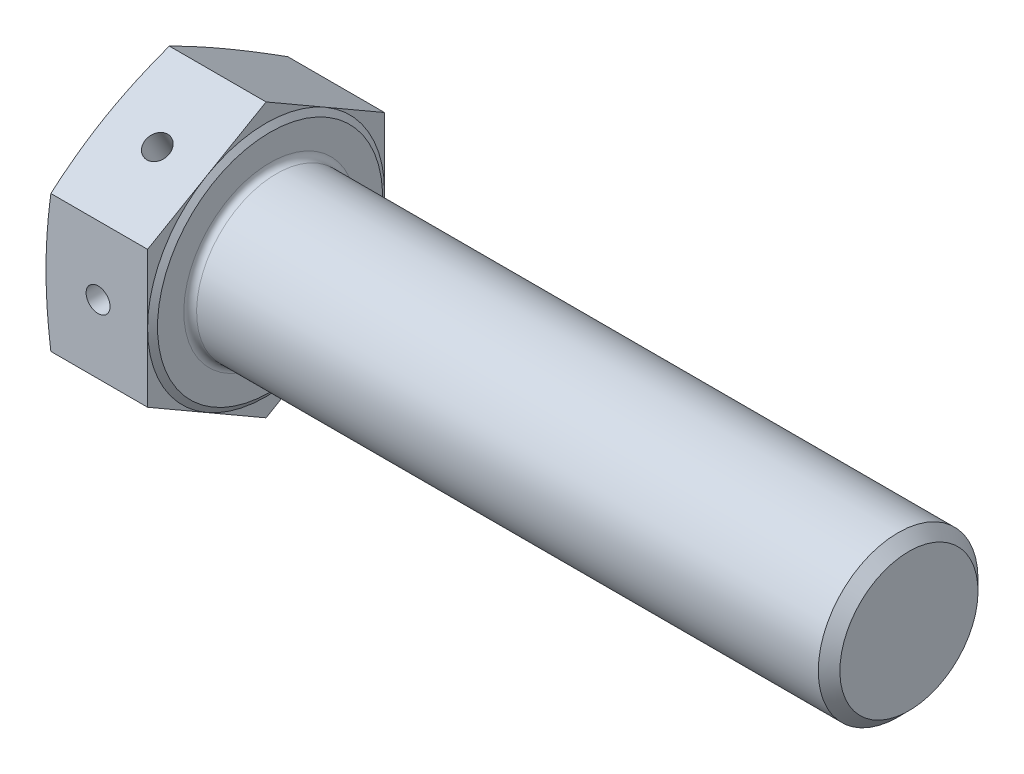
ISO-10303-21;
HEADER;
FILE_DESCRIPTION(('STEP AP214'),'2;1');
FILE_NAME('part.step','',(''),(''),'','','');
FILE_SCHEMA(('AUTOMOTIVE_DESIGN { 1 0 10303 214 1 1 1 1 }'));
ENDSEC;
DATA;
#1=APPLICATION_CONTEXT('core data for automotive mechanical design processes');
#2=APPLICATION_PROTOCOL_DEFINITION('international standard','automotive_design',2000,#1);
#3=PRODUCT_CONTEXT('',#1,'mechanical');
#4=PRODUCT('Part','Part','',(#3));
#5=PRODUCT_RELATED_PRODUCT_CATEGORY('part','',(#4));
#6=PRODUCT_DEFINITION_FORMATION('','',#4);
#7=PRODUCT_DEFINITION_CONTEXT('part definition',#1,'design');
#8=PRODUCT_DEFINITION('design','',#6,#7);
#9=PRODUCT_DEFINITION_SHAPE('','',#8);
#10=(LENGTH_UNIT() NAMED_UNIT(*) SI_UNIT(.MILLI.,.METRE.));
#11=(NAMED_UNIT(*) PLANE_ANGLE_UNIT() SI_UNIT($,.RADIAN.));
#12=(NAMED_UNIT(*) SI_UNIT($,.STERADIAN.) SOLID_ANGLE_UNIT());
#13=UNCERTAINTY_MEASURE_WITH_UNIT(LENGTH_MEASURE(1.E-05),#10,'distance_accuracy_value','');
#14=(GEOMETRIC_REPRESENTATION_CONTEXT(3) GLOBAL_UNCERTAINTY_ASSIGNED_CONTEXT((#13)) GLOBAL_UNIT_ASSIGNED_CONTEXT((#10,
#11,#12)) REPRESENTATION_CONTEXT('',''));
#15=CARTESIAN_POINT('',(0.,0.,0.));
#16=DIRECTION('',(0.,0.,1.));
#17=DIRECTION('',(1.,0.,0.));
#18=AXIS2_PLACEMENT_3D('',#15,#16,#17);
#19=CARTESIAN_POINT('',(6.52,0.,-14.835));
#20=DIRECTION('',(0.,0.,1.));
#21=DIRECTION('',(1.,0.,0.));
#22=AXIS2_PLACEMENT_3D('',#19,#20,#21);
#23=CYLINDRICAL_SURFACE('',#22,1.5);
#24=CARTESIAN_POINT('',(6.52,0.,14.835));
#25=DIRECTION('',(0.,0.,1.));
#26=DIRECTION('',(1.,0.,0.));
#27=AXIS2_PLACEMENT_3D('',#24,#25,#26);
#28=CIRCLE('',#27,1.5);
#29=CARTESIAN_POINT('',(8.02,0.,14.835));
#30=VERTEX_POINT('',#29);
#31=EDGE_CURVE('E584',#30,#30,#28,.T.);
#32=ORIENTED_EDGE('',*,*,#31,.T.);
#33=EDGE_LOOP('',(#32));
#34=FACE_BOUND('',#33,.T.);
#35=CARTESIAN_POINT('',(6.52,0.,0.));
#36=DIRECTION('',(0.,-0.866025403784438,0.500000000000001));
#37=DIRECTION('',(0.,0.500000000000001,0.866025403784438));
#38=AXIS2_PLACEMENT_3D('',#35,#36,#37);
#39=ELLIPSE('',#38,3.,1.5);
#40=CARTESIAN_POINT('',(5.02,0.,0.));
#41=VERTEX_POINT('',#40);
#42=CARTESIAN_POINT('',(8.02,0.,0.));
#43=VERTEX_POINT('',#42);
#44=EDGE_CURVE('E46',#41,#43,#39,.F.);
#45=ORIENTED_EDGE('',*,*,#44,.T.);
#46=CARTESIAN_POINT('',(6.52,0.,0.));
#47=DIRECTION('',(0.,0.500000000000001,0.866025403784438));
#48=DIRECTION('',(0.,-0.866025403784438,0.500000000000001));
#49=AXIS2_PLACEMENT_3D('',#46,#47,#48);
#50=ELLIPSE('',#49,1.73205080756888,1.5);
#51=EDGE_CURVE('E11',#43,#41,#50,.F.);
#52=ORIENTED_EDGE('',*,*,#51,.T.);
#53=EDGE_LOOP('',(#45,#52));
#54=FACE_BOUND('',#53,.T.);
#55=ADVANCED_FACE('F32',(#34,#54),#23,.F.);
#56=CARTESIAN_POINT('',(13.22,0.,0.));
#57=DIRECTION('',(-1.,0.,0.));
#58=DIRECTION('',(0.,-1.,0.));
#59=AXIS2_PLACEMENT_3D('',#56,#57,#58);
#60=PLANE('',#59);
#61=CARTESIAN_POINT('',(13.22,0.,0.));
#62=DIRECTION('',(-1.,0.,0.));
#63=DIRECTION('',(0.,-1.,0.));
#64=AXIS2_PLACEMENT_3D('',#61,#62,#63);
#65=CIRCLE('',#64,10.8);
#66=CARTESIAN_POINT('',(13.22,-10.8,0.));
#67=VERTEX_POINT('',#66);
#68=EDGE_CURVE('E137',#67,#67,#65,.T.);
#69=ORIENTED_EDGE('',*,*,#68,.T.);
#70=EDGE_LOOP('',(#69));
#71=FACE_BOUND('',#70,.T.);
#72=CARTESIAN_POINT('',(13.22,0.,0.));
#73=DIRECTION('',(-1.,0.,0.));
#74=DIRECTION('',(0.,-1.,0.));
#75=AXIS2_PLACEMENT_3D('',#72,#73,#74);
#76=CIRCLE('',#75,14.095);
#77=CARTESIAN_POINT('',(13.22,-14.095,0.));
#78=VERTEX_POINT('',#77);
#79=EDGE_CURVE('E286',#78,#78,#76,.T.);
#80=ORIENTED_EDGE('',*,*,#79,.F.);
#81=EDGE_LOOP('',(#80));
#82=FACE_BOUND('',#81,.T.);
#83=ADVANCED_FACE('F240',(#71,#82),#60,.F.);
#84=CARTESIAN_POINT('',(12.72,0.,29.67));
#85=DIRECTION('',(-1.,0.,0.));
#86=DIRECTION('',(0.,0.,1.));
#87=AXIS2_PLACEMENT_3D('',#84,#85,#86);
#88=PLANE('',#87);
#89=DIRECTION('',(0.,-0.5,-0.866025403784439));
#90=VECTOR('',#89,1.);
#91=CARTESIAN_POINT('',(12.72,-8.5649912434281,14.835));
#92=LINE('',#91,#90);
#93=CARTESIAN_POINT('',(12.72,-8.5649912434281,14.835));
#94=VERTEX_POINT('',#93);
#95=CARTESIAN_POINT('',(12.72,-12.8474868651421,7.41750000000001));
#96=VERTEX_POINT('',#95);
#97=EDGE_CURVE('E198',#94,#96,#92,.T.);
#98=ORIENTED_EDGE('',*,*,#97,.T.);
#99=CARTESIAN_POINT('',(12.72,0.,0.));
#100=DIRECTION('',(-1.,0.,0.));
#101=DIRECTION('',(0.,-1.,0.));
#102=AXIS2_PLACEMENT_3D('',#99,#100,#101);
#103=CIRCLE('',#102,14.835);
#104=CARTESIAN_POINT('',(12.72,0.,14.835));
#105=VERTEX_POINT('',#104);
#106=EDGE_CURVE('E54',#96,#105,#103,.T.);
#107=ORIENTED_EDGE('',*,*,#106,.T.);
#108=DIRECTION('',(0.,-1.,0.));
#109=VECTOR('',#108,1.);
#110=CARTESIAN_POINT('',(12.72,8.5649912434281,14.835));
#111=LINE('',#110,#109);
#112=EDGE_CURVE('E181',#105,#94,#111,.T.);
#113=ORIENTED_EDGE('',*,*,#112,.T.);
#114=EDGE_LOOP('',(#98,#107,#113));
#115=FACE_BOUND('',#114,.T.);
#116=ADVANCED_FACE('F246',(#115),#88,.F.);
#117=CARTESIAN_POINT('',(12.72,8.5649912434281,14.835));
#118=VERTEX_POINT('',#117);
#119=EDGE_CURVE('E178',#118,#105,#111,.T.);
#120=ORIENTED_EDGE('',*,*,#119,.T.);
#121=CARTESIAN_POINT('',(12.72,12.8474868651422,7.4175));
#122=VERTEX_POINT('',#121);
#123=EDGE_CURVE('E153',#105,#122,#103,.T.);
#124=ORIENTED_EDGE('',*,*,#123,.T.);
#125=DIRECTION('',(0.,-0.5,0.866025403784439));
#126=VECTOR('',#125,1.);
#127=CARTESIAN_POINT('',(12.72,17.1299824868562,0.));
#128=LINE('',#127,#126);
#129=EDGE_CURVE('E185',#122,#118,#128,.T.);
#130=ORIENTED_EDGE('',*,*,#129,.T.);
#131=EDGE_LOOP('',(#120,#124,#130));
#132=FACE_BOUND('',#131,.T.);
#133=ADVANCED_FACE('F342',(#132),#88,.F.);
#134=CARTESIAN_POINT('',(12.72,17.1299824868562,0.));
#135=VERTEX_POINT('',#134);
#136=EDGE_CURVE('E182',#135,#122,#128,.T.);
#137=ORIENTED_EDGE('',*,*,#136,.T.);
#138=CARTESIAN_POINT('',(12.72,12.8474868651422,-7.4175));
#139=VERTEX_POINT('',#138);
#140=EDGE_CURVE('E347',#122,#139,#103,.T.);
#141=ORIENTED_EDGE('',*,*,#140,.T.);
#142=DIRECTION('',(0.,0.5,0.866025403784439));
#143=VECTOR('',#142,1.);
#144=CARTESIAN_POINT('',(12.72,8.5649912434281,-14.835));
#145=LINE('',#144,#143);
#146=EDGE_CURVE('E189',#139,#135,#145,.T.);
#147=ORIENTED_EDGE('',*,*,#146,.T.);
#148=EDGE_LOOP('',(#137,#141,#147));
#149=FACE_BOUND('',#148,.T.);
#150=ADVANCED_FACE('F346',(#149),#88,.F.);
#151=CARTESIAN_POINT('',(12.72,8.5649912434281,-14.835));
#152=VERTEX_POINT('',#151);
#153=EDGE_CURVE('E186',#152,#139,#145,.T.);
#154=ORIENTED_EDGE('',*,*,#153,.T.);
#155=CARTESIAN_POINT('',(12.72,0.,-14.835));
#156=VERTEX_POINT('',#155);
#157=EDGE_CURVE('E418',#139,#156,#103,.T.);
#158=ORIENTED_EDGE('',*,*,#157,.T.);
#159=DIRECTION('',(0.,1.,0.));
#160=VECTOR('',#159,1.);
#161=CARTESIAN_POINT('',(12.72,-8.56499124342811,-14.835));
#162=LINE('',#161,#160);
#163=EDGE_CURVE('E193',#156,#152,#162,.T.);
#164=ORIENTED_EDGE('',*,*,#163,.T.);
#165=EDGE_LOOP('',(#154,#158,#164));
#166=FACE_BOUND('',#165,.T.);
#167=ADVANCED_FACE('F405',(#166),#88,.F.);
#168=CARTESIAN_POINT('',(12.72,-8.56499124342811,-14.835));
#169=VERTEX_POINT('',#168);
#170=EDGE_CURVE('E190',#169,#156,#162,.T.);
#171=ORIENTED_EDGE('',*,*,#170,.T.);
#172=CARTESIAN_POINT('',(12.72,-12.8474868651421,-7.4175));
#173=VERTEX_POINT('',#172);
#174=EDGE_CURVE('E413',#156,#173,#103,.T.);
#175=ORIENTED_EDGE('',*,*,#174,.T.);
#176=DIRECTION('',(0.,0.5,-0.866025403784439));
#177=VECTOR('',#176,1.);
#178=CARTESIAN_POINT('',(12.72,-17.1299824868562,0.));
#179=LINE('',#178,#177);
#180=EDGE_CURVE('E197',#173,#169,#179,.T.);
#181=ORIENTED_EDGE('',*,*,#180,.T.);
#182=EDGE_LOOP('',(#171,#175,#181));
#183=FACE_BOUND('',#182,.T.);
#184=ADVANCED_FACE('F235',(#183),#88,.F.);
#185=CARTESIAN_POINT('',(12.72,-8.5649912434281,14.835));
#186=DIRECTION('',(0.,0.866025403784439,-0.5));
#187=DIRECTION('',(0.,0.5,0.866025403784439));
#188=AXIS2_PLACEMENT_3D('',#185,#186,#187);
#189=PLANE('',#188);
#190=CARTESIAN_POINT('',(0.60789114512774,-17.13009795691,-0.000199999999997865));
#191=CARTESIAN_POINT('',(0.513635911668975,-16.7743787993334,0.615923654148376));
#192=CARTESIAN_POINT('',(0.428072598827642,-16.4180292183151,1.233139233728));
#193=CARTESIAN_POINT('',(0.277751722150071,-15.7041003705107,2.46970027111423));
#194=CARTESIAN_POINT('',(0.213002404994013,-15.3465206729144,3.08904647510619));
#195=CARTESIAN_POINT('',(0.108076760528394,-14.6322503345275,4.32619899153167));
#196=CARTESIAN_POINT('',(0.0677781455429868,-14.2755643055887,4.94399731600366));
#197=CARTESIAN_POINT('',(0.0137422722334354,-13.5617477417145,6.18036387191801));
#198=CARTESIAN_POINT('',(0.,-13.2046173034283,6.798931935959));
#199=CARTESIAN_POINT('',(0.,-12.490356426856,8.036068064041));
#200=CARTESIAN_POINT('',(0.0137422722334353,-12.1332259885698,8.65463612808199));
#201=CARTESIAN_POINT('',(0.0677781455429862,-11.4194094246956,9.89100268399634));
#202=CARTESIAN_POINT('',(0.108076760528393,-11.0627233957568,10.5088010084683));
#203=CARTESIAN_POINT('',(0.213002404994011,-10.3484530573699,11.7459535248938));
#204=CARTESIAN_POINT('',(0.277751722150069,-9.9908733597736,12.3652997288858));
#205=CARTESIAN_POINT('',(0.428072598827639,-9.27694451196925,13.601860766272));
#206=CARTESIAN_POINT('',(0.513635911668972,-8.92059493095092,14.2190763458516));
#207=CARTESIAN_POINT('',(0.607891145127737,-8.56487577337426,14.8352));
#208=B_SPLINE_CURVE_WITH_KNOTS('',3,(#190,#191,#192,#193,#194,#195,#196,#197,#198,#199,#200,
#201,#202,#203,#204,#205,#206,#207),.UNSPECIFIED.,.F.,.F.,(4,2,2,2,2,2,2,2,4),(0.,
2.1530746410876,4.30700130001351,6.45006455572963,8.59272315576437,10.7353817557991,
12.8784450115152,15.0323716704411,17.1854463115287),.UNSPECIFIED.);
#209=CARTESIAN_POINT('',(0.607860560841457,-17.1299824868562,0.));
#210=VERTEX_POINT('',#209);
#211=CARTESIAN_POINT('',(0.,-12.8474868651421,7.41750000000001));
#212=VERTEX_POINT('',#211);
#213=EDGE_CURVE('E357',#210,#212,#208,.T.);
#214=ORIENTED_EDGE('',*,*,#213,.F.);
#215=DIRECTION('',(-1.,0.,0.));
#216=VECTOR('',#215,1.);
#217=CARTESIAN_POINT('',(12.72,-17.1299824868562,0.));
#218=LINE('',#217,#216);
#219=CARTESIAN_POINT('',(12.72,-17.1299824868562,0.));
#220=VERTEX_POINT('',#219);
#221=EDGE_CURVE('E160',#220,#210,#218,.T.);
#222=ORIENTED_EDGE('',*,*,#221,.F.);
#223=EDGE_CURVE('E201',#96,#220,#92,.T.);
#224=ORIENTED_EDGE('',*,*,#223,.F.);
#225=ORIENTED_EDGE('',*,*,#97,.F.);
#226=DIRECTION('',(-1.,0.,0.));
#227=VECTOR('',#226,1.);
#228=CARTESIAN_POINT('',(12.72,-8.5649912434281,14.835));
#229=LINE('',#228,#227);
#230=CARTESIAN_POINT('',(0.607860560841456,-8.56499124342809,14.835));
#231=VERTEX_POINT('',#230);
#232=EDGE_CURVE('E175',#94,#231,#229,.T.);
#233=ORIENTED_EDGE('',*,*,#232,.T.);
#234=EDGE_CURVE('E334',#212,#231,#208,.T.);
#235=ORIENTED_EDGE('',*,*,#234,.F.);
#236=EDGE_LOOP('',(#214,#222,#224,#225,#233,#235));
#237=FACE_BOUND('',#236,.T.);
#238=ADVANCED_FACE('F34',(#237),#189,.F.);
#239=CARTESIAN_POINT('',(12.72,-17.1299824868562,0.));
#240=DIRECTION('',(0.,0.866025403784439,0.5));
#241=DIRECTION('',(0.,-0.5,0.866025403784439));
#242=AXIS2_PLACEMENT_3D('',#239,#240,#241);
#243=PLANE('',#242);
#244=CARTESIAN_POINT('',(6.52,-12.8474868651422,-7.41749999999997));
#245=DIRECTION('',(0.,0.866025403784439,0.5));
#246=DIRECTION('',(0.,-0.5,0.866025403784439));
#247=AXIS2_PLACEMENT_3D('',#244,#245,#246);
#248=CIRCLE('',#247,1.5);
#249=CARTESIAN_POINT('',(6.52,-13.5974868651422,-6.11846189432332));
#250=VERTEX_POINT('',#249);
#251=EDGE_CURVE('E582',#250,#250,#248,.T.);
#252=ORIENTED_EDGE('',*,*,#251,.T.);
#253=EDGE_LOOP('',(#252));
#254=FACE_BOUND('',#253,.T.);
#255=CARTESIAN_POINT('',(0.607891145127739,-8.56487577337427,-14.8352));
#256=CARTESIAN_POINT('',(0.513635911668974,-8.92059493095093,-14.2190763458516));
#257=CARTESIAN_POINT('',(0.428072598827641,-9.27694451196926,-13.601860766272));
#258=CARTESIAN_POINT('',(0.27775172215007,-9.9908733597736,-12.3652997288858));
#259=CARTESIAN_POINT('',(0.213002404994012,-10.3484530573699,-11.7459535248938));
#260=CARTESIAN_POINT('',(0.108076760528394,-11.0627233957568,-10.5088010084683));
#261=CARTESIAN_POINT('',(0.0677781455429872,-11.4194094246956,-9.89100268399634));
#262=CARTESIAN_POINT('',(0.0137422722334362,-12.1332259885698,-8.654636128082));
#263=CARTESIAN_POINT('',(0.,-12.490356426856,-8.036068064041));
#264=CARTESIAN_POINT('',(0.,-13.2046173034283,-6.798931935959));
#265=CARTESIAN_POINT('',(0.0137422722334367,-13.5617477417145,-6.180363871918));
#266=CARTESIAN_POINT('',(0.0677781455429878,-14.2755643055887,-4.94399731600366));
#267=CARTESIAN_POINT('',(0.108076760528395,-14.6322503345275,-4.32619899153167));
#268=CARTESIAN_POINT('',(0.213002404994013,-15.3465206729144,-3.08904647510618));
#269=CARTESIAN_POINT('',(0.277751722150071,-15.7041003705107,-2.46970027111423));
#270=CARTESIAN_POINT('',(0.428072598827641,-16.4180292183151,-1.233139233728));
#271=CARTESIAN_POINT('',(0.513635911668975,-16.7743787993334,-0.615923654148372));
#272=CARTESIAN_POINT('',(0.607891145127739,-17.13009795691,0.000200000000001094));
#273=B_SPLINE_CURVE_WITH_KNOTS('',3,(#255,#256,#257,#258,#259,#260,#261,#262,#263,#264,#265,
#266,#267,#268,#269,#270,#271,#272),.UNSPECIFIED.,.F.,.F.,(4,2,2,2,2,2,2,2,4),(0.,
2.1530746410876,4.30700130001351,6.45006455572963,8.59272315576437,10.7353817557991,
12.8784450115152,15.0323716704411,17.1854463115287),.UNSPECIFIED.);
#274=CARTESIAN_POINT('',(0.607860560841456,-8.56499124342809,-14.835));
#275=VERTEX_POINT('',#274);
#276=CARTESIAN_POINT('',(0.,-12.8474868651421,-7.41749999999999));
#277=VERTEX_POINT('',#276);
#278=EDGE_CURVE('E356',#275,#277,#273,.T.);
#279=ORIENTED_EDGE('',*,*,#278,.F.);
#280=DIRECTION('',(-1.,0.,0.));
#281=VECTOR('',#280,1.);
#282=CARTESIAN_POINT('',(12.72,-8.56499124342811,-14.835));
#283=LINE('',#282,#281);
#284=EDGE_CURVE('E163',#169,#275,#283,.T.);
#285=ORIENTED_EDGE('',*,*,#284,.F.);
#286=ORIENTED_EDGE('',*,*,#180,.F.);
#287=EDGE_CURVE('E194',#220,#173,#179,.T.);
#288=ORIENTED_EDGE('',*,*,#287,.F.);
#289=ORIENTED_EDGE('',*,*,#221,.T.);
#290=EDGE_CURVE('E211',#277,#210,#273,.T.);
#291=ORIENTED_EDGE('',*,*,#290,.F.);
#292=EDGE_LOOP('',(#279,#285,#286,#288,#289,#291));
#293=FACE_BOUND('',#292,.T.);
#294=ADVANCED_FACE('F225',(#254,#293),#243,.F.);
#295=CARTESIAN_POINT('',(12.72,-8.56499124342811,-14.835));
#296=DIRECTION('',(0.,0.,1.));
#297=DIRECTION('',(0.,-1.,0.));
#298=AXIS2_PLACEMENT_3D('',#295,#296,#297);
#299=PLANE('',#298);
#300=CARTESIAN_POINT('',(6.52,0.,-14.835));
#301=DIRECTION('',(0.,0.,1.));
#302=DIRECTION('',(1.,0.,0.));
#303=AXIS2_PLACEMENT_3D('',#300,#301,#302);
#304=CIRCLE('',#303,1.5);
#305=CARTESIAN_POINT('',(8.02,0.,-14.835));
#306=VERTEX_POINT('',#305);
#307=EDGE_CURVE('E292',#306,#306,#304,.T.);
#308=ORIENTED_EDGE('',*,*,#307,.T.);
#309=EDGE_LOOP('',(#308));
#310=FACE_BOUND('',#309,.T.);
#311=CARTESIAN_POINT('',(3.24073364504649,-22.6435467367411,-14.835));
#312=CARTESIAN_POINT('',(3.09169371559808,-21.9706549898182,-14.835));
#313=CARTESIAN_POINT('',(2.94448108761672,-21.2973511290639,-14.835));
#314=CARTESIAN_POINT('',(2.65469598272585,-19.9497170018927,-14.835));
#315=CARTESIAN_POINT('',(2.51212370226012,-19.2753866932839,-14.835));
#316=CARTESIAN_POINT('',(2.23248327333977,-17.9249055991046,-14.835));
#317=CARTESIAN_POINT('',(2.09542054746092,-17.2487536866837,-14.835));
#318=CARTESIAN_POINT('',(1.82827742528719,-15.8950726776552,-14.835));
#319=CARTESIAN_POINT('',(1.69819697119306,-15.2175435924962,-14.835));
#320=CARTESIAN_POINT('',(1.4476596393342,-13.8661552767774,-14.835));
#321=CARTESIAN_POINT('',(1.32713573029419,-13.1923085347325,-14.835));
#322=CARTESIAN_POINT('',(1.09662873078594,-11.8428002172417,-14.835));
#323=CARTESIAN_POINT('',(0.986645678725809,-11.1671386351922,-14.835));
#324=CARTESIAN_POINT('',(0.77970248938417,-9.81389998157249,-14.835));
#325=CARTESIAN_POINT('',(0.682740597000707,-9.13632318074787,-14.835));
#326=CARTESIAN_POINT('',(0.504694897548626,-7.77906277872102,-14.835));
#327=CARTESIAN_POINT('',(0.423611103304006,-7.09937917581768,-14.835));
#328=CARTESIAN_POINT('',(0.279635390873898,-5.73043224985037,-14.835));
#329=CARTESIAN_POINT('',(0.21695530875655,-5.04114631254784,-14.835));
#330=CARTESIAN_POINT('',(0.114073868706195,-3.66088443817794,-14.835));
#331=CARTESIAN_POINT('',(0.0738720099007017,-2.96990853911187,-14.835));
#332=CARTESIAN_POINT('',(0.0182843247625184,-1.58724427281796,-14.835));
#333=CARTESIAN_POINT('',(0.0028875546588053,-0.895556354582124,-14.835));
#334=CARTESIAN_POINT('',(-0.00214587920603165,0.487914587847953,-14.835));
#335=CARTESIAN_POINT('',(0.00821743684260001,1.17969761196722,-14.835));
#336=CARTESIAN_POINT('',(0.0541217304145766,2.56486995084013,-14.835));
#337=CARTESIAN_POINT('',(0.0897519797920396,3.25825624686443,-14.835));
#338=CARTESIAN_POINT('',(0.1841617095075,4.64343646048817,-14.835));
#339=CARTESIAN_POINT('',(0.242941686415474,5.33523034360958,-14.835));
#340=CARTESIAN_POINT('',(0.380690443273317,6.71721777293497,-14.835));
#341=CARTESIAN_POINT('',(0.459672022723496,7.40741002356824,-14.835));
#342=CARTESIAN_POINT('',(0.634546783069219,8.78562502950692,-14.835));
#343=CARTESIAN_POINT('',(0.730440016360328,9.47364777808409,-14.835));
#344=CARTESIAN_POINT('',(0.929225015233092,10.8018124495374,-14.835));
#345=CARTESIAN_POINT('',(1.03122435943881,11.4420893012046,-14.835));
#346=CARTESIAN_POINT('',(1.24512872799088,12.7209943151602,-14.835));
#347=CARTESIAN_POINT('',(1.35703401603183,13.3596224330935,-14.835));
#348=CARTESIAN_POINT('',(1.58894553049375,14.6354636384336,-14.835));
#349=CARTESIAN_POINT('',(1.7089525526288,15.2726765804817,-14.835));
#350=CARTESIAN_POINT('',(1.95557681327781,16.5458115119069,-14.835));
#351=CARTESIAN_POINT('',(2.08219399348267,17.1817335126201,-14.835));
#352=CARTESIAN_POINT('',(2.3408781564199,18.4526212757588,-14.835));
#353=CARTESIAN_POINT('',(2.47294641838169,19.0875867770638,-14.835));
#354=CARTESIAN_POINT('',(2.74155043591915,20.3565711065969,-14.835));
#355=CARTESIAN_POINT('',(2.87808619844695,20.9905899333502,-14.835));
#356=CARTESIAN_POINT('',(3.15485129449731,22.2577781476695,-14.835));
#357=CARTESIAN_POINT('',(3.29508039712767,22.8909475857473,-14.835));
#358=CARTESIAN_POINT('',(3.5786325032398,24.1565939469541,-14.835));
#359=CARTESIAN_POINT('',(3.72195551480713,24.7890708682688,-14.835));
#360=CARTESIAN_POINT('',(4.1530222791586,26.6734698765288,-14.835));
#361=CARTESIAN_POINT('',(4.44454320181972,27.9245278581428,-14.835));
#362=CARTESIAN_POINT('',(5.034888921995,30.4249356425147,-14.835));
#363=CARTESIAN_POINT('',(5.33371384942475,31.6742854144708,-14.835));
#364=CARTESIAN_POINT('',(5.93642411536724,34.1701627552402,-14.835));
#365=CARTESIAN_POINT('',(6.2403028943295,35.4166919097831,-14.835));
#366=CARTESIAN_POINT('',(6.6991995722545,37.2857072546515,-14.835));
#367=CARTESIAN_POINT('',(6.85267577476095,37.9085728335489,-14.835));
#368=CARTESIAN_POINT('',(7.16053767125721,39.1540785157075,-14.835));
#369=CARTESIAN_POINT('',(7.314923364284,39.7767186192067,-14.835));
#370=CARTESIAN_POINT('',(7.46970485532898,40.3992603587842,-14.835));
#371=B_SPLINE_CURVE_WITH_KNOTS('',3,(#311,#312,#313,#314,#315,#316,#317,#318,#319,#320,#321,
#322,#323,#324,#325,#326,#327,#328,#329,#330,#331,#332,#333,#334,#335,#336,#337,#338,#339,#340,
#341,#342,#343,#344,#345,#346,#347,#348,#349,#350,#351,#352,#353,#354,#355,#356,#357,#358,#359,
#360,#361,#362,#363,#364,#365,#366,#367,#368,#369,#370),.UNSPECIFIED.,.F.,.F.,(4,2,2,2,2,2,2,2,
2,2,2,2,2,2,2,2,2,2,2,2,2,2,2,2,2,2,2,2,2,4),(0.,2.0676073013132,4.1353020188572,
6.20498430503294,8.27464945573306,10.3282035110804,12.3817650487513,14.4350495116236,
16.488335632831,18.5644045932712,20.6404272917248,22.7155338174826,24.7906387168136,
26.8731120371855,28.9556300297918,31.0394707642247,33.1233179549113,35.0682777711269,
37.0132893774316,38.9584922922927,40.9036780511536,42.849322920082,44.7949708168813,
46.7404973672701,48.6860290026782,52.5397160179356,56.3934716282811,60.2425648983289,
62.1670509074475,64.0915348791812),.UNSPECIFIED.);
#372=CARTESIAN_POINT('',(0.607860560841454,8.5649912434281,-14.835));
#373=VERTEX_POINT('',#372);
#374=CARTESIAN_POINT('',(0.,0.,-14.835));
#375=VERTEX_POINT('',#374);
#376=EDGE_CURVE('E209',#373,#375,#371,.F.);
#377=ORIENTED_EDGE('',*,*,#376,.F.);
#378=DIRECTION('',(-1.,0.,0.));
#379=VECTOR('',#378,1.);
#380=CARTESIAN_POINT('',(12.72,8.5649912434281,-14.835));
#381=LINE('',#380,#379);
#382=EDGE_CURVE('E166',#152,#373,#381,.T.);
#383=ORIENTED_EDGE('',*,*,#382,.F.);
#384=ORIENTED_EDGE('',*,*,#163,.F.);
#385=ORIENTED_EDGE('',*,*,#170,.F.);
#386=ORIENTED_EDGE('',*,*,#284,.T.);
#387=EDGE_CURVE('E202',#375,#275,#371,.F.);
#388=ORIENTED_EDGE('',*,*,#387,.F.);
#389=EDGE_LOOP('',(#377,#383,#384,#385,#386,#388));
#390=FACE_BOUND('',#389,.T.);
#391=ADVANCED_FACE('F220',(#310,#390),#299,.F.);
#392=CARTESIAN_POINT('',(12.72,8.5649912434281,-14.835));
#393=DIRECTION('',(0.,-0.866025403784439,0.5));
#394=DIRECTION('',(0.,-0.5,-0.866025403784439));
#395=AXIS2_PLACEMENT_3D('',#392,#393,#394);
#396=PLANE('',#395);
#397=CARTESIAN_POINT('',(0.607891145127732,17.13009795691,0.000199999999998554));
#398=CARTESIAN_POINT('',(0.513635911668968,16.7743787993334,-0.615923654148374));
#399=CARTESIAN_POINT('',(0.428072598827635,16.418029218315,-1.233139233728));
#400=CARTESIAN_POINT('',(0.277751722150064,15.7041003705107,-2.46970027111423));
#401=CARTESIAN_POINT('',(0.213002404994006,15.3465206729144,-3.08904647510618));
#402=CARTESIAN_POINT('',(0.108076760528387,14.6322503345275,-4.32619899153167));
#403=CARTESIAN_POINT('',(0.0677781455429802,14.2755643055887,-4.94399731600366));
#404=CARTESIAN_POINT('',(0.0137422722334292,13.5617477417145,-6.180363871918));
#405=CARTESIAN_POINT('',(0.,13.2046173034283,-6.798931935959));
#406=CARTESIAN_POINT('',(0.,12.490356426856,-8.036068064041));
#407=CARTESIAN_POINT('',(0.0137422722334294,12.1332259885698,-8.65463612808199));
#408=CARTESIAN_POINT('',(0.0677781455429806,11.4194094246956,-9.89100268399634));
#409=CARTESIAN_POINT('',(0.108076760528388,11.0627233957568,-10.5088010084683));
#410=CARTESIAN_POINT('',(0.213002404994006,10.3484530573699,-11.7459535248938));
#411=CARTESIAN_POINT('',(0.277751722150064,9.99087335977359,-12.3652997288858));
#412=CARTESIAN_POINT('',(0.428072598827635,9.27694451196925,-13.601860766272));
#413=CARTESIAN_POINT('',(0.513635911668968,8.92059493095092,-14.2190763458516));
#414=CARTESIAN_POINT('',(0.607891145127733,8.56487577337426,-14.8352));
#415=B_SPLINE_CURVE_WITH_KNOTS('',3,(#397,#398,#399,#400,#401,#402,#403,#404,#405,#406,#407,
#408,#409,#410,#411,#412,#413,#414),.UNSPECIFIED.,.F.,.F.,(4,2,2,2,2,2,2,2,4),(0.,
2.15307464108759,4.30700130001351,6.45006455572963,8.59272315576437,10.7353817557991,
12.8784450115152,15.0323716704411,17.1854463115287),.UNSPECIFIED.);
#416=CARTESIAN_POINT('',(0.607860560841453,17.1299824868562,0.));
#417=VERTEX_POINT('',#416);
#418=CARTESIAN_POINT('',(0.,12.8474868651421,-7.41749999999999));
#419=VERTEX_POINT('',#418);
#420=EDGE_CURVE('E353',#417,#419,#415,.T.);
#421=ORIENTED_EDGE('',*,*,#420,.F.);
#422=DIRECTION('',(-1.,0.,0.));
#423=VECTOR('',#422,1.);
#424=CARTESIAN_POINT('',(12.72,17.1299824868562,0.));
#425=LINE('',#424,#423);
#426=EDGE_CURVE('E169',#135,#417,#425,.T.);
#427=ORIENTED_EDGE('',*,*,#426,.F.);
#428=ORIENTED_EDGE('',*,*,#146,.F.);
#429=ORIENTED_EDGE('',*,*,#153,.F.);
#430=ORIENTED_EDGE('',*,*,#382,.T.);
#431=EDGE_CURVE('E210',#419,#373,#415,.T.);
#432=ORIENTED_EDGE('',*,*,#431,.F.);
#433=EDGE_LOOP('',(#421,#427,#428,#429,#430,#432));
#434=FACE_BOUND('',#433,.T.);
#435=ADVANCED_FACE('F224',(#434),#396,.F.);
#436=CARTESIAN_POINT('',(12.72,17.1299824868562,0.));
#437=DIRECTION('',(0.,-0.866025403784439,-0.5));
#438=DIRECTION('',(0.,0.5,-0.866025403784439));
#439=AXIS2_PLACEMENT_3D('',#436,#437,#438);
#440=PLANE('',#439);
#441=CARTESIAN_POINT('',(6.52,12.8474868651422,7.41749999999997));
#442=DIRECTION('',(0.,-0.866025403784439,-0.5));
#443=DIRECTION('',(0.,0.5,-0.866025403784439));
#444=AXIS2_PLACEMENT_3D('',#441,#442,#443);
#445=CIRCLE('',#444,1.5);
#446=CARTESIAN_POINT('',(6.52,13.5974868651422,6.11846189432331));
#447=VERTEX_POINT('',#446);
#448=EDGE_CURVE('E324',#447,#447,#445,.T.);
#449=ORIENTED_EDGE('',*,*,#448,.T.);
#450=EDGE_LOOP('',(#449));
#451=FACE_BOUND('',#450,.T.);
#452=CARTESIAN_POINT('',(0.607891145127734,8.56487577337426,14.8352));
#453=CARTESIAN_POINT('',(0.513635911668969,8.92059493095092,14.2190763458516));
#454=CARTESIAN_POINT('',(0.428072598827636,9.27694451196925,13.601860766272));
#455=CARTESIAN_POINT('',(0.277751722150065,9.99087335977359,12.3652997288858));
#456=CARTESIAN_POINT('',(0.213002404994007,10.3484530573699,11.7459535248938));
#457=CARTESIAN_POINT('',(0.108076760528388,11.0627233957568,10.5088010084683));
#458=CARTESIAN_POINT('',(0.0677781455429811,11.4194094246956,9.89100268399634));
#459=CARTESIAN_POINT('',(0.0137422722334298,12.1332259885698,8.65463612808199));
#460=CARTESIAN_POINT('',(0.,12.490356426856,8.036068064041));
#461=CARTESIAN_POINT('',(0.,13.2046173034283,6.798931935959));
#462=CARTESIAN_POINT('',(0.0137422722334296,13.5617477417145,6.180363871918));
#463=CARTESIAN_POINT('',(0.0677781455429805,14.2755643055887,4.94399731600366));
#464=CARTESIAN_POINT('',(0.108076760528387,14.6322503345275,4.32619899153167));
#465=CARTESIAN_POINT('',(0.213002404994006,15.3465206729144,3.08904647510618));
#466=CARTESIAN_POINT('',(0.277751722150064,15.7041003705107,2.46970027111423));
#467=CARTESIAN_POINT('',(0.428072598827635,16.418029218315,1.233139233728));
#468=CARTESIAN_POINT('',(0.513635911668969,16.7743787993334,0.615923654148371));
#469=CARTESIAN_POINT('',(0.607891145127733,17.13009795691,-0.000200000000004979));
#470=B_SPLINE_CURVE_WITH_KNOTS('',3,(#452,#453,#454,#455,#456,#457,#458,#459,#460,#461,#462,
#463,#464,#465,#466,#467,#468,#469),.UNSPECIFIED.,.F.,.F.,(4,2,2,2,2,2,2,2,4),(0.,
2.1530746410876,4.30700130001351,6.45006455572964,8.59272315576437,10.7353817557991,
12.8784450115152,15.0323716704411,17.1854463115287),.UNSPECIFIED.);
#471=CARTESIAN_POINT('',(0.607860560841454,8.56499124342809,14.835));
#472=VERTEX_POINT('',#471);
#473=CARTESIAN_POINT('',(0.,12.8474868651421,7.4175));
#474=VERTEX_POINT('',#473);
#475=EDGE_CURVE('E302',#472,#474,#470,.T.);
#476=ORIENTED_EDGE('',*,*,#475,.F.);
#477=DIRECTION('',(-1.,0.,0.));
#478=VECTOR('',#477,1.);
#479=CARTESIAN_POINT('',(12.72,8.5649912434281,14.835));
#480=LINE('',#479,#478);
#481=EDGE_CURVE('E172',#118,#472,#480,.T.);
#482=ORIENTED_EDGE('',*,*,#481,.F.);
#483=ORIENTED_EDGE('',*,*,#129,.F.);
#484=ORIENTED_EDGE('',*,*,#136,.F.);
#485=ORIENTED_EDGE('',*,*,#426,.T.);
#486=EDGE_CURVE('E330',#474,#417,#470,.T.);
#487=ORIENTED_EDGE('',*,*,#486,.F.);
#488=EDGE_LOOP('',(#476,#482,#483,#484,#485,#487));
#489=FACE_BOUND('',#488,.T.);
#490=ADVANCED_FACE('F312',(#451,#489),#440,.F.);
#491=CARTESIAN_POINT('',(12.72,8.5649912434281,14.835));
#492=DIRECTION('',(0.,0.,-1.));
#493=DIRECTION('',(-1.,0.,0.));
#494=AXIS2_PLACEMENT_3D('',#491,#492,#493);
#495=PLANE('',#494);
#496=ORIENTED_EDGE('',*,*,#31,.F.);
#497=EDGE_LOOP('',(#496));
#498=FACE_BOUND('',#497,.T.);
#499=CARTESIAN_POINT('',(3.24073331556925,-22.643545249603,14.835));
#500=CARTESIAN_POINT('',(3.09169340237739,-21.970653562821,14.835));
#501=CARTESIAN_POINT('',(2.94448079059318,-21.2973497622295,14.835));
#502=CARTESIAN_POINT('',(2.65469571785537,-19.9497157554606,14.835));
#503=CARTESIAN_POINT('',(2.51212345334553,-19.2753855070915,14.835));
#504=CARTESIAN_POINT('',(2.23248305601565,-17.9249045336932,14.835));
#505=CARTESIAN_POINT('',(2.09542034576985,-17.248752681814,14.835));
#506=CARTESIAN_POINT('',(1.82827725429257,-15.8950717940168,14.835));
#507=CARTESIAN_POINT('',(1.69819681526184,-15.2175427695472,14.835));
#508=CARTESIAN_POINT('',(1.44765951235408,-13.8661545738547,14.835));
#509=CARTESIAN_POINT('',(1.32713561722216,-13.1923078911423,14.835));
#510=CARTESIAN_POINT('',(1.09662864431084,-11.8427996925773,14.835));
#511=CARTESIAN_POINT('',(0.986645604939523,-11.1671381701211,14.835));
#512=CARTESIAN_POINT('',(0.779702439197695,-9.81389963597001,14.835));
#513=CARTESIAN_POINT('',(0.682740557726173,-9.13632289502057,14.835));
#514=CARTESIAN_POINT('',(0.504694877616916,-7.77906261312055,14.835));
#515=CARTESIAN_POINT('',(0.423611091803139,-7.09937907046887,14.835));
#516=CARTESIAN_POINT('',(0.279635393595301,-5.73043227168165,14.835));
#517=CARTESIAN_POINT('',(0.216955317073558,-5.04114640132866,14.835));
#518=CARTESIAN_POINT('',(0.11407388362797,-3.66088466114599,14.835));
#519=CARTESIAN_POINT('',(0.0738720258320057,-2.96990882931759,14.835));
#520=CARTESIAN_POINT('',(0.0182843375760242,-1.58724469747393,14.835));
#521=CARTESIAN_POINT('',(0.00288756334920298,-0.895556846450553,14.835));
#522=CARTESIAN_POINT('',(-0.00214588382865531,0.487913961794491,14.835));
#523=CARTESIAN_POINT('',(0.0082174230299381,1.17969691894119,14.835));
#524=CARTESIAN_POINT('',(0.0541216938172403,2.56486912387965,14.835));
#525=CARTESIAN_POINT('',(0.0897519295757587,3.2582553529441,14.835));
#526=CARTESIAN_POINT('',(0.184161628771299,4.64343543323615,14.835));
#527=CARTESIAN_POINT('',(0.242941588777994,5.33522924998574,14.835));
#528=CARTESIAN_POINT('',(0.380690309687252,6.71721654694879,14.835));
#529=CARTESIAN_POINT('',(0.459671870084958,7.40740873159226,14.835));
#530=CARTESIAN_POINT('',(0.634546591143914,8.78562360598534,14.835));
#531=CARTESIAN_POINT('',(0.730439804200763,9.47364628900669,14.835));
#532=CARTESIAN_POINT('',(0.929224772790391,10.8018108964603,14.835));
#533=CARTESIAN_POINT('',(1.03122410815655,11.4420877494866,14.835));
#534=CARTESIAN_POINT('',(1.24512846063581,12.720992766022,14.835));
#535=CARTESIAN_POINT('',(1.35703374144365,13.359620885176,14.835));
#536=CARTESIAN_POINT('',(1.5889452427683,14.6354620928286,14.835));
#537=CARTESIAN_POINT('',(1.70895225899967,15.2726750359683,14.835));
#538=CARTESIAN_POINT('',(1.95557650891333,16.5458099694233,14.835));
#539=CARTESIAN_POINT('',(2.08219368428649,17.1817319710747,14.835));
#540=CARTESIAN_POINT('',(2.34087783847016,18.4526197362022,14.835));
#541=CARTESIAN_POINT('',(2.47294609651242,19.0875852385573,14.835));
#542=CARTESIAN_POINT('',(2.74155010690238,20.3565695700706,14.835));
#543=CARTESIAN_POINT('',(2.8780858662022,20.990588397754,14.835));
#544=CARTESIAN_POINT('',(3.15485095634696,22.257776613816,14.835));
#545=CARTESIAN_POINT('',(3.29508005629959,22.8909460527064,14.835));
#546=CARTESIAN_POINT('',(3.57863215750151,24.1565924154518,14.835));
#547=CARTESIAN_POINT('',(3.72195516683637,24.7890693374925,14.835));
#548=CARTESIAN_POINT('',(4.15302192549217,26.6734683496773,14.835));
#549=CARTESIAN_POINT('',(4.44454284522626,27.9245263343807,14.835));
#550=CARTESIAN_POINT('',(5.03488856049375,30.4249341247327,14.835));
#551=CARTESIAN_POINT('',(5.33371348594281,31.6742838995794,14.835));
#552=CARTESIAN_POINT('',(5.93642374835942,34.1701612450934,14.835));
#553=CARTESIAN_POINT('',(6.24030252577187,35.4166904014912,14.835));
#554=CARTESIAN_POINT('',(6.69919920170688,37.2857057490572,14.835));
#555=CARTESIAN_POINT('',(6.85267540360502,37.9085713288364,14.835));
#556=CARTESIAN_POINT('',(7.16053729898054,39.1540770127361,14.835));
#557=CARTESIAN_POINT('',(7.31492299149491,39.7767171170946,14.835));
#558=CARTESIAN_POINT('',(7.46970448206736,40.3992588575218,14.835));
#559=B_SPLINE_CURVE_WITH_KNOTS('',3,(#499,#500,#501,#502,#503,#504,#505,#506,#507,#508,#509,
#510,#511,#512,#513,#514,#515,#516,#517,#518,#519,#520,#521,#522,#523,#524,#525,#526,#527,#528,
#529,#530,#531,#532,#533,#534,#535,#536,#537,#538,#539,#540,#541,#542,#543,#544,#545,#546,#547,
#548,#549,#550,#551,#552,#553,#554,#555,#556,#557,#558),.UNSPECIFIED.,.F.,.F.,(4,2,2,2,2,2,2,2,
2,2,2,2,2,2,2,2,2,2,2,2,2,2,2,2,2,2,2,2,2,4),(0.,2.06760711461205,4.13530164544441,
6.2049837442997,8.27464870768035,10.3282025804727,12.3817639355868,14.435048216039,
16.4883341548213,18.5644029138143,20.6404254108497,22.7155317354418,24.7906364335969,
26.8731095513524,28.955627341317,31.0394678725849,33.1233148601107,35.0682746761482,
37.0132862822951,38.9584891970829,40.9036749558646,42.8493198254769,44.7949677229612,
46.7404942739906,48.6860259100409,52.5397129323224,56.3934685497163,60.2425618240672,
62.1670478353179,64.0915318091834),.UNSPECIFIED.);
#560=CARTESIAN_POINT('',(0.,0.,14.835));
#561=VERTEX_POINT('',#560);
#562=EDGE_CURVE('E301',#231,#561,#559,.T.);
#563=ORIENTED_EDGE('',*,*,#562,.F.);
#564=ORIENTED_EDGE('',*,*,#232,.F.);
#565=ORIENTED_EDGE('',*,*,#112,.F.);
#566=ORIENTED_EDGE('',*,*,#119,.F.);
#567=ORIENTED_EDGE('',*,*,#481,.T.);
#568=EDGE_CURVE('E290',#561,#472,#559,.T.);
#569=ORIENTED_EDGE('',*,*,#568,.F.);
#570=EDGE_LOOP('',(#563,#564,#565,#566,#567,#569));
#571=FACE_BOUND('',#570,.T.);
#572=ADVANCED_FACE('F307',(#498,#571),#495,.F.);
#573=ORIENTED_EDGE('',*,*,#287,.T.);
#574=EDGE_CURVE('E157',#173,#96,#103,.T.);
#575=ORIENTED_EDGE('',*,*,#574,.T.);
#576=ORIENTED_EDGE('',*,*,#223,.T.);
#577=EDGE_LOOP('',(#573,#575,#576));
#578=FACE_BOUND('',#577,.T.);
#579=ADVANCED_FACE('F311',(#578),#88,.F.);
#580=CARTESIAN_POINT('',(0.,0.,0.));
#581=DIRECTION('',(1.,0.,0.));
#582=DIRECTION('',(0.,1.,0.));
#583=AXIS2_PLACEMENT_3D('',#580,#581,#582);
#584=CONICAL_SURFACE('',#583,14.835,1.31187673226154);
#585=ORIENTED_EDGE('',*,*,#234,.T.);
#586=ORIENTED_EDGE('',*,*,#562,.T.);
#587=CARTESIAN_POINT('',(0.,0.,0.));
#588=DIRECTION('',(-1.,0.,0.));
#589=DIRECTION('',(0.,-1.,0.));
#590=AXIS2_PLACEMENT_3D('',#587,#588,#589);
#591=CIRCLE('',#590,14.835);
#592=EDGE_CURVE('E288',#212,#561,#591,.T.);
#593=ORIENTED_EDGE('',*,*,#592,.F.);
#594=EDGE_LOOP('',(#585,#586,#593));
#595=FACE_BOUND('',#594,.T.);
#596=ADVANCED_FACE('F392',(#595),#584,.T.);
#597=ORIENTED_EDGE('',*,*,#290,.T.);
#598=ORIENTED_EDGE('',*,*,#213,.T.);
#599=CARTESIAN_POINT('',(0.,0.,0.));
#600=DIRECTION('',(-1.,0.,0.));
#601=DIRECTION('',(0.,0.,1.));
#602=AXIS2_PLACEMENT_3D('',#599,#600,#601);
#603=CIRCLE('',#602,14.835);
#604=EDGE_CURVE('E159',#277,#212,#603,.T.);
#605=ORIENTED_EDGE('',*,*,#604,.F.);
#606=EDGE_LOOP('',(#597,#598,#605));
#607=FACE_BOUND('',#606,.T.);
#608=ADVANCED_FACE('F376',(#607),#584,.T.);
#609=ORIENTED_EDGE('',*,*,#387,.T.);
#610=ORIENTED_EDGE('',*,*,#278,.T.);
#611=EDGE_CURVE('E369',#375,#277,#603,.T.);
#612=ORIENTED_EDGE('',*,*,#611,.F.);
#613=EDGE_LOOP('',(#609,#610,#612));
#614=FACE_BOUND('',#613,.T.);
#615=ADVANCED_FACE('F367',(#614),#584,.T.);
#616=ORIENTED_EDGE('',*,*,#376,.T.);
#617=EDGE_CURVE('E381',#419,#375,#603,.T.);
#618=ORIENTED_EDGE('',*,*,#617,.F.);
#619=ORIENTED_EDGE('',*,*,#431,.T.);
#620=EDGE_LOOP('',(#616,#618,#619));
#621=FACE_BOUND('',#620,.T.);
#622=ADVANCED_FACE('F216',(#621),#584,.T.);
#623=ORIENTED_EDGE('',*,*,#420,.T.);
#624=EDGE_CURVE('E158',#474,#419,#603,.T.);
#625=ORIENTED_EDGE('',*,*,#624,.F.);
#626=ORIENTED_EDGE('',*,*,#486,.T.);
#627=EDGE_LOOP('',(#623,#625,#626));
#628=FACE_BOUND('',#627,.T.);
#629=ADVANCED_FACE('F403',(#628),#584,.T.);
#630=ORIENTED_EDGE('',*,*,#475,.T.);
#631=EDGE_CURVE('E154',#561,#474,#603,.T.);
#632=ORIENTED_EDGE('',*,*,#631,.F.);
#633=ORIENTED_EDGE('',*,*,#568,.T.);
#634=EDGE_LOOP('',(#630,#632,#633));
#635=FACE_BOUND('',#634,.T.);
#636=ADVANCED_FACE('F281',(#635),#584,.T.);
#637=CARTESIAN_POINT('',(0.,0.,29.67));
#638=DIRECTION('',(-1.,0.,0.));
#639=DIRECTION('',(0.,0.,1.));
#640=AXIS2_PLACEMENT_3D('',#637,#638,#639);
#641=PLANE('',#640);
#642=ORIENTED_EDGE('',*,*,#592,.T.);
#643=ORIENTED_EDGE('',*,*,#631,.T.);
#644=ORIENTED_EDGE('',*,*,#624,.T.);
#645=ORIENTED_EDGE('',*,*,#617,.T.);
#646=ORIENTED_EDGE('',*,*,#611,.T.);
#647=ORIENTED_EDGE('',*,*,#604,.T.);
#648=EDGE_LOOP('',(#642,#643,#644,#645,#646,#647));
#649=FACE_BOUND('',#648,.T.);
#650=ADVANCED_FACE('F277',(#649),#641,.T.);
#651=CARTESIAN_POINT('',(13.22,0.,0.));
#652=DIRECTION('',(-1.,0.,0.));
#653=DIRECTION('',(0.,-1.,0.));
#654=AXIS2_PLACEMENT_3D('',#651,#652,#653);
#655=CONICAL_SURFACE('',#654,14.095,0.976582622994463);
#656=ORIENTED_EDGE('',*,*,#106,.F.);
#657=ORIENTED_EDGE('',*,*,#574,.F.);
#658=ORIENTED_EDGE('',*,*,#174,.F.);
#659=ORIENTED_EDGE('',*,*,#157,.F.);
#660=ORIENTED_EDGE('',*,*,#140,.F.);
#661=ORIENTED_EDGE('',*,*,#123,.F.);
#662=EDGE_LOOP('',(#656,#657,#658,#659,#660,#661));
#663=FACE_BOUND('',#662,.T.);
#664=ORIENTED_EDGE('',*,*,#79,.T.);
#665=EDGE_LOOP('',(#664));
#666=FACE_BOUND('',#665,.T.);
#667=ADVANCED_FACE('F274',(#663,#666),#655,.T.);
#668=CARTESIAN_POINT('',(93.22,0.,0.));
#669=DIRECTION('',(-1.,0.,0.));
#670=DIRECTION('',(0.,-1.,0.));
#671=AXIS2_PLACEMENT_3D('',#668,#669,#670);
#672=CYLINDRICAL_SURFACE('',#671,10.);
#673=CARTESIAN_POINT('',(14.02,0.,0.));
#674=DIRECTION('',(-1.,0.,0.));
#675=DIRECTION('',(0.,-1.,0.));
#676=AXIS2_PLACEMENT_3D('',#673,#674,#675);
#677=CIRCLE('',#676,10.);
#678=CARTESIAN_POINT('',(14.02,-10.,0.));
#679=VERTEX_POINT('',#678);
#680=EDGE_CURVE('E144',#679,#679,#677,.F.);
#681=ORIENTED_EDGE('',*,*,#680,.T.);
#682=EDGE_LOOP('',(#681));
#683=FACE_BOUND('',#682,.T.);
#684=CARTESIAN_POINT('',(91.867,0.,0.));
#685=DIRECTION('',(1.,0.,0.));
#686=DIRECTION('',(0.,1.,0.));
#687=AXIS2_PLACEMENT_3D('',#684,#685,#686);
#688=CIRCLE('',#687,10.);
#689=CARTESIAN_POINT('',(91.867,10.,0.));
#690=VERTEX_POINT('',#689);
#691=EDGE_CURVE('E147',#690,#690,#688,.F.);
#692=ORIENTED_EDGE('',*,*,#691,.T.);
#693=EDGE_LOOP('',(#692));
#694=FACE_BOUND('',#693,.T.);
#695=ADVANCED_FACE('F270',(#683,#694),#672,.T.);
#696=CARTESIAN_POINT('',(93.22,0.,0.));
#697=DIRECTION('',(1.,0.,0.));
#698=DIRECTION('',(0.,1.,0.));
#699=AXIS2_PLACEMENT_3D('',#696,#697,#698);
#700=PLANE('',#699);
#701=CARTESIAN_POINT('',(93.22,0.,0.));
#702=DIRECTION('',(1.,0.,0.));
#703=DIRECTION('',(0.,1.,0.));
#704=AXIS2_PLACEMENT_3D('',#701,#702,#703);
#705=CIRCLE('',#704,8.647);
#706=CARTESIAN_POINT('',(93.22,8.64700000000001,0.));
#707=VERTEX_POINT('',#706);
#708=EDGE_CURVE('E150',#707,#707,#705,.T.);
#709=ORIENTED_EDGE('',*,*,#708,.T.);
#710=EDGE_LOOP('',(#709));
#711=FACE_BOUND('',#710,.T.);
#712=ADVANCED_FACE('F262',(#711),#700,.T.);
#713=CARTESIAN_POINT('',(93.22,0.,0.));
#714=DIRECTION('',(-1.,0.,0.));
#715=DIRECTION('',(0.,-1.,0.));
#716=AXIS2_PLACEMENT_3D('',#713,#714,#715);
#717=CONICAL_SURFACE('',#716,8.647,0.785398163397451);
#718=ORIENTED_EDGE('',*,*,#691,.F.);
#719=EDGE_LOOP('',(#718));
#720=FACE_BOUND('',#719,.T.);
#721=ORIENTED_EDGE('',*,*,#708,.F.);
#722=EDGE_LOOP('',(#721));
#723=FACE_BOUND('',#722,.T.);
#724=ADVANCED_FACE('F257',(#720,#723),#717,.T.);
#725=CARTESIAN_POINT('',(14.02,0.,0.));
#726=DIRECTION('',(-1.,0.,0.));
#727=DIRECTION('',(0.,-1.,0.));
#728=AXIS2_PLACEMENT_3D('',#725,#726,#727);
#729=TOROIDAL_SURFACE('',#728,10.8,0.8);
#730=ORIENTED_EDGE('',*,*,#68,.F.);
#731=EDGE_LOOP('',(#730));
#732=FACE_BOUND('',#731,.T.);
#733=ORIENTED_EDGE('',*,*,#680,.F.);
#734=EDGE_LOOP('',(#733));
#735=FACE_BOUND('',#734,.T.);
#736=ADVANCED_FACE('F252',(#732,#735),#729,.F.);
#737=CARTESIAN_POINT('',(6.52,0.,0.));
#738=DIRECTION('',(0.,-0.866025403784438,0.500000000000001));
#739=DIRECTION('',(0.,0.500000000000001,0.866025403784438));
#740=AXIS2_PLACEMENT_3D('',#737,#738,#739);
#741=ELLIPSE('',#740,3.,1.5);
#742=EDGE_CURVE('E128',#41,#43,#741,.T.);
#743=ORIENTED_EDGE('',*,*,#742,.T.);
#744=CARTESIAN_POINT('',(6.52,0.,0.));
#745=DIRECTION('',(0.,0.500000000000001,0.866025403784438));
#746=DIRECTION('',(0.,-0.866025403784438,0.500000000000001));
#747=AXIS2_PLACEMENT_3D('',#744,#745,#746);
#748=ELLIPSE('',#747,1.73205080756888,1.5);
#749=EDGE_CURVE('E41',#43,#41,#748,.T.);
#750=ORIENTED_EDGE('',*,*,#749,.T.);
#751=EDGE_LOOP('',(#743,#750));
#752=FACE_BOUND('',#751,.T.);
#753=ORIENTED_EDGE('',*,*,#307,.F.);
#754=EDGE_LOOP('',(#753));
#755=FACE_BOUND('',#754,.T.);
#756=ADVANCED_FACE('F139',(#752,#755),#23,.F.);
#757=CARTESIAN_POINT('',(6.52,-19.2712302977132,-11.12625));
#758=DIRECTION('',(0.,0.86602540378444,0.499999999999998));
#759=DIRECTION('',(0.,-0.499999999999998,0.86602540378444));
#760=AXIS2_PLACEMENT_3D('',#757,#758,#759);
#761=CYLINDRICAL_SURFACE('',#760,1.5);
#762=ORIENTED_EDGE('',*,*,#44,.F.);
#763=ORIENTED_EDGE('',*,*,#749,.F.);
#764=EDGE_LOOP('',(#762,#763));
#765=FACE_BOUND('',#764,.T.);
#766=ORIENTED_EDGE('',*,*,#448,.F.);
#767=EDGE_LOOP('',(#766));
#768=FACE_BOUND('',#767,.T.);
#769=ADVANCED_FACE('F135',(#765,#768),#761,.F.);
#770=ORIENTED_EDGE('',*,*,#742,.F.);
#771=ORIENTED_EDGE('',*,*,#51,.F.);
#772=EDGE_LOOP('',(#770,#771));
#773=FACE_BOUND('',#772,.T.);
#774=ORIENTED_EDGE('',*,*,#251,.F.);
#775=EDGE_LOOP('',(#774));
#776=FACE_BOUND('',#775,.T.);
#777=ADVANCED_FACE('F129',(#773,#776),#761,.F.);
#778=CLOSED_SHELL('',(#55,#83,#116,#133,#150,#167,#184,#238,#294,#391,#435,#490,#572,#579,#596,
#608,#615,#622,#629,#636,#650,#667,#695,#712,#724,#736,#756,#769,#777));
#779=MANIFOLD_SOLID_BREP('B2',#778);
#780=ADVANCED_BREP_SHAPE_REPRESENTATION('',(#18,#779),#14);
#781=SHAPE_DEFINITION_REPRESENTATION(#9,#780);
ENDSEC;
END-ISO-10303-21;
